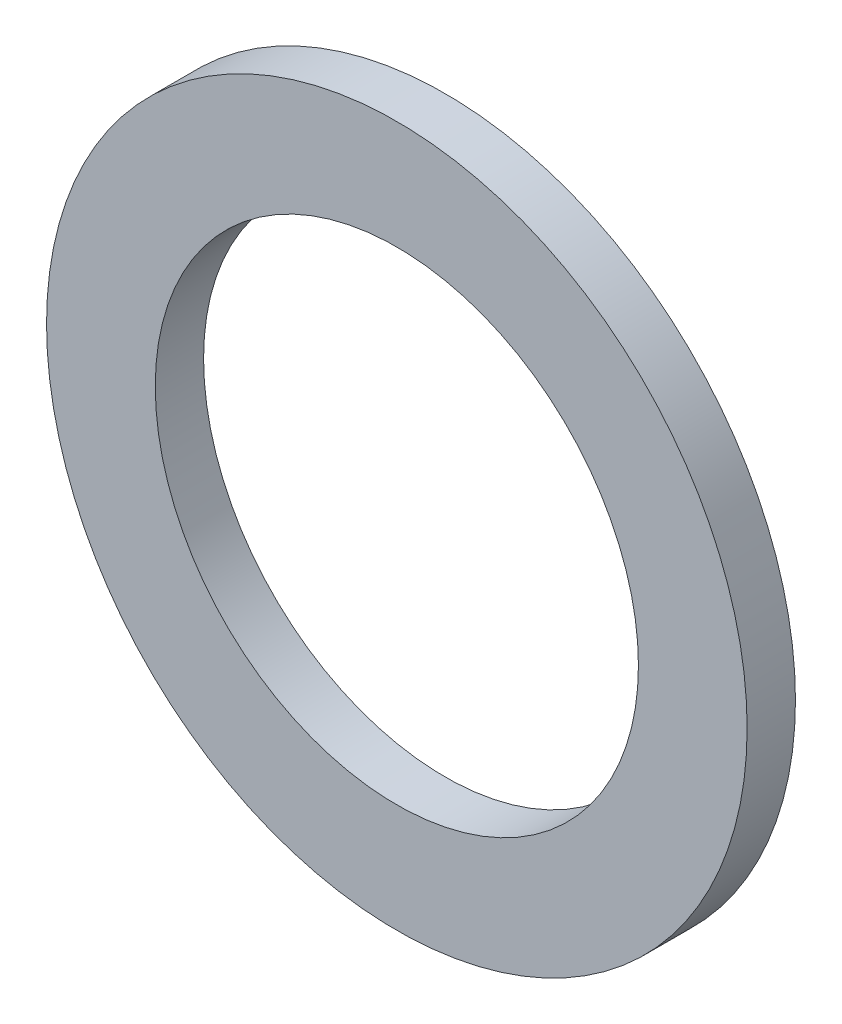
from build123d import *

# Parameters (mm, degrees)
SKETCH_1_R      = 14.5
SKETCH_1_R_2    = 10
EXTRUDE_1_DEPTH = 2


with BuildPart() as part:
    # Sketch 1 → Extrude 1 (new body)
    with BuildSketch(Plane.XY):
        with Locations((4.5, 0)):
            Circle(SKETCH_1_R)
        with Locations((4.5, 0)):
            Circle(SKETCH_1_R_2, mode=Mode.SUBTRACT)
    extrude(amount=-EXTRUDE_1_DEPTH)


solid = part.part
